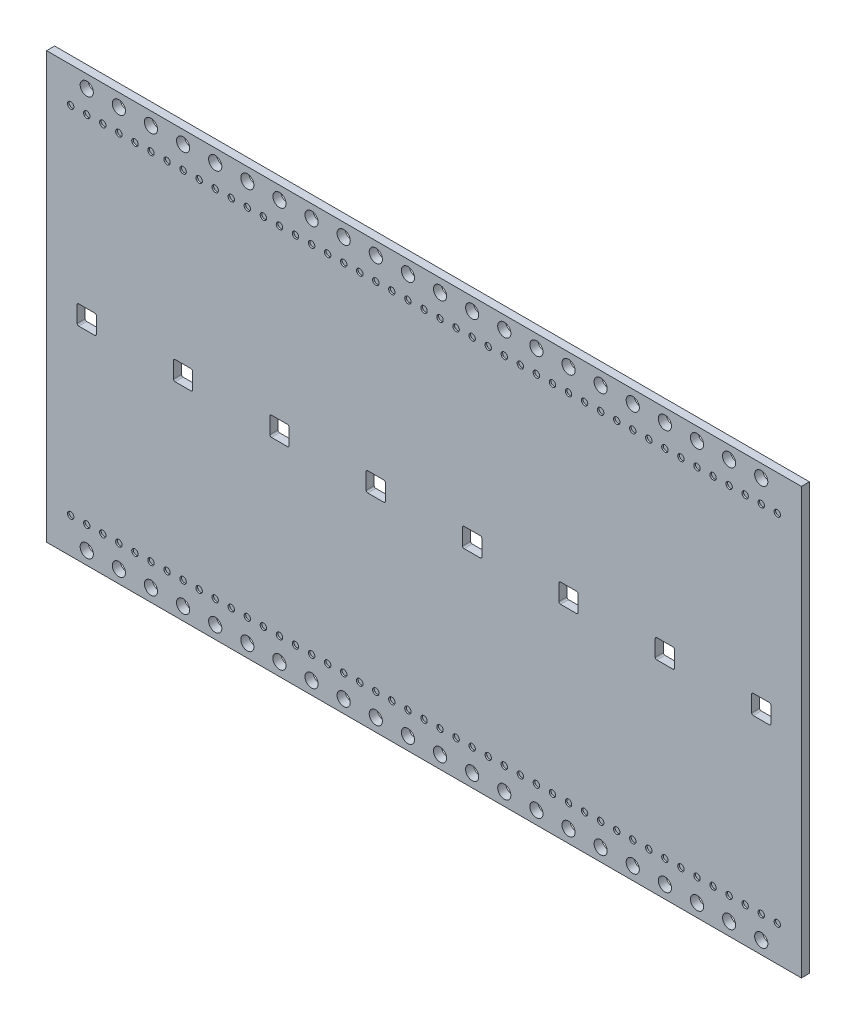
from build123d import *

# Parameters (mm, degrees)
SKETCH_1_W          = 235
SKETCH_1_H          = 132.55
SKETCH_1_R          = 2.05
EXTRUDE_1_DEPTH     = 1.25
SKETCH_2_R          = 1
CUT_EXTRUDE_1_DEPTH = 0.5
SKETCH_3_R          = 1
EXTRUDE_2_DEPTH     = 1
CUT_EXTRUDE_2_DEPTH = 10


with BuildPart() as part:
    # Sketch 1 → Extrude 1 (new, symmetric)
    with BuildSketch(Plane.XY):
        Rectangle(SKETCH_1_W, SKETCH_1_H)
        with Locations((-105, 62.275)):
            Circle(SKETCH_1_R, mode=Mode.SUBTRACT)
        with Locations((-95, 62.275)):
            Circle(SKETCH_1_R, mode=Mode.SUBTRACT)
        with Locations((-95, -62.275)):
            Circle(SKETCH_1_R, mode=Mode.SUBTRACT)
        with Locations((-85, 62.275)):
            Circle(SKETCH_1_R, mode=Mode.SUBTRACT)
        with Locations((-85, -62.275)):
            Circle(SKETCH_1_R, mode=Mode.SUBTRACT)
        with Locations((-75, 62.275)):
            Circle(SKETCH_1_R, mode=Mode.SUBTRACT)
        with Locations((-75, -62.275)):
            Circle(SKETCH_1_R, mode=Mode.SUBTRACT)
        with Locations((-65, 62.275)):
            Circle(SKETCH_1_R, mode=Mode.SUBTRACT)
        with Locations((-65, -62.275)):
            Circle(SKETCH_1_R, mode=Mode.SUBTRACT)
        with Locations((-55, 62.275)):
            Circle(SKETCH_1_R, mode=Mode.SUBTRACT)
        with Locations((-55, -62.275)):
            Circle(SKETCH_1_R, mode=Mode.SUBTRACT)
        with Locations((-45, 62.275)):
            Circle(SKETCH_1_R, mode=Mode.SUBTRACT)
        with Locations((-45, -62.275)):
            Circle(SKETCH_1_R, mode=Mode.SUBTRACT)
        with Locations((-35, 62.275)):
            Circle(SKETCH_1_R, mode=Mode.SUBTRACT)
        with Locations((-35, -62.275)):
            Circle(SKETCH_1_R, mode=Mode.SUBTRACT)
        with Locations((-25, 62.275)):
            Circle(SKETCH_1_R, mode=Mode.SUBTRACT)
        with Locations((-25, -62.275)):
            Circle(SKETCH_1_R, mode=Mode.SUBTRACT)
        with Locations((-15, 62.275)):
            Circle(SKETCH_1_R, mode=Mode.SUBTRACT)
        with Locations((-15, -62.275)):
            Circle(SKETCH_1_R, mode=Mode.SUBTRACT)
        with Locations((-5, 62.275)):
            Circle(SKETCH_1_R, mode=Mode.SUBTRACT)
        with Locations((-5, -62.275)):
            Circle(SKETCH_1_R, mode=Mode.SUBTRACT)
        with Locations((5, 62.275)):
            Circle(SKETCH_1_R, mode=Mode.SUBTRACT)
        with Locations((5, -62.275)):
            Circle(SKETCH_1_R, mode=Mode.SUBTRACT)
        with Locations((15, 62.275)):
            Circle(SKETCH_1_R, mode=Mode.SUBTRACT)
        with Locations((15, -62.275)):
            Circle(SKETCH_1_R, mode=Mode.SUBTRACT)
        with Locations((25, 62.275)):
            Circle(SKETCH_1_R, mode=Mode.SUBTRACT)
        with Locations((25, -62.275)):
            Circle(SKETCH_1_R, mode=Mode.SUBTRACT)
        with Locations((35, 62.275)):
            Circle(SKETCH_1_R, mode=Mode.SUBTRACT)
        with Locations((35, -62.275)):
            Circle(SKETCH_1_R, mode=Mode.SUBTRACT)
        with Locations((45, 62.275)):
            Circle(SKETCH_1_R, mode=Mode.SUBTRACT)
        with Locations((45, -62.275)):
            Circle(SKETCH_1_R, mode=Mode.SUBTRACT)
        with Locations((55, 62.275)):
            Circle(SKETCH_1_R, mode=Mode.SUBTRACT)
        with Locations((55, -62.275)):
            Circle(SKETCH_1_R, mode=Mode.SUBTRACT)
        with Locations((65, 62.275)):
            Circle(SKETCH_1_R, mode=Mode.SUBTRACT)
        with Locations((65, -62.275)):
            Circle(SKETCH_1_R, mode=Mode.SUBTRACT)
        with Locations((75, 62.275)):
            Circle(SKETCH_1_R, mode=Mode.SUBTRACT)
        with Locations((75, -62.275)):
            Circle(SKETCH_1_R, mode=Mode.SUBTRACT)
        with Locations((85, 62.275)):
            Circle(SKETCH_1_R, mode=Mode.SUBTRACT)
        with Locations((85, -62.275)):
            Circle(SKETCH_1_R, mode=Mode.SUBTRACT)
        with Locations((95, 62.275)):
            Circle(SKETCH_1_R, mode=Mode.SUBTRACT)
        with Locations((95, -62.275)):
            Circle(SKETCH_1_R, mode=Mode.SUBTRACT)
        with Locations((105, 62.275)):
            Circle(SKETCH_1_R, mode=Mode.SUBTRACT)
        with Locations((105, -62.275)):
            Circle(SKETCH_1_R, mode=Mode.SUBTRACT)
        with Locations((-105, -62.275)):
            Circle(SKETCH_1_R, mode=Mode.SUBTRACT)
    extrude(amount=EXTRUDE_1_DEPTH, both=True)

    # Sketch 2 → Cut-Extrude 1 (cut)
    with BuildSketch(Plane.XY.offset(1.25)):
        with Locations((-110, 55.275)):
            Circle(SKETCH_2_R)
        with Locations((-110, -55.275)):
            Circle(SKETCH_2_R)
        with Locations((-105, 55.275)):
            Circle(SKETCH_2_R)
        with Locations((-105, -55.275)):
            Circle(SKETCH_2_R)
        with Locations((-100, 55.275)):
            Circle(SKETCH_2_R)
        with Locations((-100, -55.275)):
            Circle(SKETCH_2_R)
        with Locations((-95, 55.275)):
            Circle(SKETCH_2_R)
        with Locations((-95, -55.275)):
            Circle(SKETCH_2_R)
        with Locations((-90, 55.275)):
            Circle(SKETCH_2_R)
        with Locations((-90, -55.275)):
            Circle(SKETCH_2_R)
        with Locations((-85, 55.275)):
            Circle(SKETCH_2_R)
        with Locations((-85, -55.275)):
            Circle(SKETCH_2_R)
        with Locations((-80, 55.275)):
            Circle(SKETCH_2_R)
        with Locations((-80, -55.275)):
            Circle(SKETCH_2_R)
        with Locations((-75, 55.275)):
            Circle(SKETCH_2_R)
        with Locations((-75, -55.275)):
            Circle(SKETCH_2_R)
        with Locations((-70, 55.275)):
            Circle(SKETCH_2_R)
        with Locations((-70, -55.275)):
            Circle(SKETCH_2_R)
        with Locations((-65, 55.275)):
            Circle(SKETCH_2_R)
        with Locations((-65, -55.275)):
            Circle(SKETCH_2_R)
        with Locations((-60, 55.275)):
            Circle(SKETCH_2_R)
        with Locations((-60, -55.275)):
            Circle(SKETCH_2_R)
        with Locations((-55, 55.275)):
            Circle(SKETCH_2_R)
        with Locations((-55, -55.275)):
            Circle(SKETCH_2_R)
        with Locations((-50, 55.275)):
            Circle(SKETCH_2_R)
        with Locations((-50, -55.275)):
            Circle(SKETCH_2_R)
        with Locations((-45, 55.275)):
            Circle(SKETCH_2_R)
        with Locations((-45, -55.275)):
            Circle(SKETCH_2_R)
        with Locations((-40, 55.275)):
            Circle(SKETCH_2_R)
        with Locations((-40, -55.275)):
            Circle(SKETCH_2_R)
        with Locations((-35, 55.275)):
            Circle(SKETCH_2_R)
        with Locations((-35, -55.275)):
            Circle(SKETCH_2_R)
        with Locations((-30, 55.275)):
            Circle(SKETCH_2_R)
        with Locations((-30, -55.275)):
            Circle(SKETCH_2_R)
        with Locations((-25, 55.275)):
            Circle(SKETCH_2_R)
        with Locations((-25, -55.275)):
            Circle(SKETCH_2_R)
        with Locations((-20, 55.275)):
            Circle(SKETCH_2_R)
        with Locations((-20, -55.275)):
            Circle(SKETCH_2_R)
        with Locations((-15, 55.275)):
            Circle(SKETCH_2_R)
        with Locations((-15, -55.275)):
            Circle(SKETCH_2_R)
        with Locations((-10, 55.275)):
            Circle(SKETCH_2_R)
        with Locations((-10, -55.275)):
            Circle(SKETCH_2_R)
        with Locations((-5, 55.275)):
            Circle(SKETCH_2_R)
        with Locations((-5, -55.275)):
            Circle(SKETCH_2_R)
        with Locations((0, 55.275)):
            Circle(SKETCH_2_R)
        with Locations((0, -55.275)):
            Circle(SKETCH_2_R)
        with Locations((5, 55.275)):
            Circle(SKETCH_2_R)
        with Locations((5, -55.275)):
            Circle(SKETCH_2_R)
        with Locations((10, 55.275)):
            Circle(SKETCH_2_R)
        with Locations((10, -55.275)):
            Circle(SKETCH_2_R)
        with Locations((15, 55.275)):
            Circle(SKETCH_2_R)
        with Locations((15, -55.275)):
            Circle(SKETCH_2_R)
        with Locations((20, 55.275)):
            Circle(SKETCH_2_R)
        with Locations((20, -55.275)):
            Circle(SKETCH_2_R)
        with Locations((25, 55.275)):
            Circle(SKETCH_2_R)
        with Locations((25, -55.275)):
            Circle(SKETCH_2_R)
        with Locations((30, 55.275)):
            Circle(SKETCH_2_R)
        with Locations((30, -55.275)):
            Circle(SKETCH_2_R)
        with Locations((35, 55.275)):
            Circle(SKETCH_2_R)
        with Locations((35, -55.275)):
            Circle(SKETCH_2_R)
        with Locations((40, 55.275)):
            Circle(SKETCH_2_R)
        with Locations((40, -55.275)):
            Circle(SKETCH_2_R)
        with Locations((45, 55.275)):
            Circle(SKETCH_2_R)
        with Locations((45, -55.275)):
            Circle(SKETCH_2_R)
        with Locations((50, 55.275)):
            Circle(SKETCH_2_R)
        with Locations((50, -55.275)):
            Circle(SKETCH_2_R)
        with Locations((55, 55.275)):
            Circle(SKETCH_2_R)
        with Locations((55, -55.275)):
            Circle(SKETCH_2_R)
        with Locations((60, 55.275)):
            Circle(SKETCH_2_R)
        with Locations((60, -55.275)):
            Circle(SKETCH_2_R)
        with Locations((65, 55.275)):
            Circle(SKETCH_2_R)
        with Locations((65, -55.275)):
            Circle(SKETCH_2_R)
        with Locations((70, 55.275)):
            Circle(SKETCH_2_R)
        with Locations((70, -55.275)):
            Circle(SKETCH_2_R)
        with Locations((75, 55.275)):
            Circle(SKETCH_2_R)
        with Locations((75, -55.275)):
            Circle(SKETCH_2_R)
        with Locations((80, 55.275)):
            Circle(SKETCH_2_R)
        with Locations((80, -55.275)):
            Circle(SKETCH_2_R)
        with Locations((85, 55.275)):
            Circle(SKETCH_2_R)
        with Locations((85, -55.275)):
            Circle(SKETCH_2_R)
        with Locations((90, 55.275)):
            Circle(SKETCH_2_R)
        with Locations((90, -55.275)):
            Circle(SKETCH_2_R)
        with Locations((95, 55.275)):
            Circle(SKETCH_2_R)
        with Locations((95, -55.275)):
            Circle(SKETCH_2_R)
        with Locations((100, 55.275)):
            Circle(SKETCH_2_R)
        with Locations((100, -55.275)):
            Circle(SKETCH_2_R)
        with Locations((105, 55.275)):
            Circle(SKETCH_2_R)
        with Locations((105, -55.275)):
            Circle(SKETCH_2_R)
        with Locations((110, 55.275)):
            Circle(SKETCH_2_R)
        with Locations((110, -55.275)):
            Circle(SKETCH_2_R)
    extrude(amount=-CUT_EXTRUDE_1_DEPTH, mode=Mode.SUBTRACT)

    # Sketch 3 → Extrude 2 (add)
    with BuildSketch(Plane(origin=(0, 0, -1.25), x_dir=(-1, 0, 0), z_dir=(0, 0, -1))):
        with Locations(Location((110, 55.275, 0), (0, 0, 180))):
            Circle(SKETCH_3_R)
        with Locations(Location((110, -55.275, 0), (0, 0, 180))):
            Circle(SKETCH_3_R)
        with Locations(Location((105, 55.275, 0), (0, 0, 180))):
            Circle(SKETCH_3_R)
        with Locations(Location((105, -55.275, 0), (0, 0, 180))):
            Circle(SKETCH_3_R)
        with Locations(Location((100, 55.275, 0), (0, 0, 180))):
            Circle(SKETCH_3_R)
        with Locations(Location((100, -55.275, 0), (0, 0, 180))):
            Circle(SKETCH_3_R)
        with Locations(Location((95, 55.275, 0), (0, 0, 180))):
            Circle(SKETCH_3_R)
        with Locations(Location((95, -55.275, 0), (0, 0, 180))):
            Circle(SKETCH_3_R)
        with Locations(Location((90, 55.275, 0), (0, 0, 180))):
            Circle(SKETCH_3_R)
        with Locations(Location((90, -55.275, 0), (0, 0, 180))):
            Circle(SKETCH_3_R)
        with Locations(Location((85, 55.275, 0), (0, 0, 180))):
            Circle(SKETCH_3_R)
        with Locations(Location((85, -55.275, 0), (0, 0, 180))):
            Circle(SKETCH_3_R)
        with Locations(Location((80, 55.275, 0), (0, 0, 180))):
            Circle(SKETCH_3_R)
        with Locations(Location((80, -55.275, 0), (0, 0, 180))):
            Circle(SKETCH_3_R)
        with Locations(Location((75, 55.275, 0), (0, 0, 180))):
            Circle(SKETCH_3_R)
        with Locations(Location((75, -55.275, 0), (0, 0, 180))):
            Circle(SKETCH_3_R)
        with Locations(Location((70, 55.275, 0), (0, 0, 180))):
            Circle(SKETCH_3_R)
        with Locations(Location((70, -55.275, 0), (0, 0, 180))):
            Circle(SKETCH_3_R)
        with Locations(Location((65, 55.275, 0), (0, 0, 180))):
            Circle(SKETCH_3_R)
        with Locations(Location((65, -55.275, 0), (0, 0, 180))):
            Circle(SKETCH_3_R)
        with Locations(Location((60, 55.275, 0), (0, 0, 180))):
            Circle(SKETCH_3_R)
        with Locations(Location((60, -55.275, 0), (0, 0, 180))):
            Circle(SKETCH_3_R)
        with Locations(Location((55, 55.275, 0), (0, 0, 180))):
            Circle(SKETCH_3_R)
        with Locations(Location((55, -55.275, 0), (0, 0, 180))):
            Circle(SKETCH_3_R)
        with Locations(Location((50, 55.275, 0), (0, 0, 180))):
            Circle(SKETCH_3_R)
        with Locations(Location((50, -55.275, 0), (0, 0, 180))):
            Circle(SKETCH_3_R)
        with Locations(Location((45, 55.275, 0), (0, 0, 180))):
            Circle(SKETCH_3_R)
        with Locations(Location((45, -55.275, 0), (0, 0, 180))):
            Circle(SKETCH_3_R)
        with Locations(Location((40, 55.275, 0), (0, 0, 180))):
            Circle(SKETCH_3_R)
        with Locations(Location((40, -55.275, 0), (0, 0, 180))):
            Circle(SKETCH_3_R)
        with Locations(Location((35, 55.275, 0), (0, 0, 180))):
            Circle(SKETCH_3_R)
        with Locations(Location((35, -55.275, 0), (0, 0, 180))):
            Circle(SKETCH_3_R)
        with Locations(Location((30, 55.275, 0), (0, 0, 180))):
            Circle(SKETCH_3_R)
        with Locations(Location((30, -55.275, 0), (0, 0, 180))):
            Circle(SKETCH_3_R)
        with Locations(Location((25, 55.275, 0), (0, 0, 180))):
            Circle(SKETCH_3_R)
        with Locations(Location((25, -55.275, 0), (0, 0, 180))):
            Circle(SKETCH_3_R)
        with Locations(Location((20, 55.275, 0), (0, 0, 180))):
            Circle(SKETCH_3_R)
        with Locations(Location((20, -55.275, 0), (0, 0, 180))):
            Circle(SKETCH_3_R)
        with Locations(Location((15, 55.275, 0), (0, 0, 180))):
            Circle(SKETCH_3_R)
        with Locations(Location((15, -55.275, 0), (0, 0, 180))):
            Circle(SKETCH_3_R)
        with Locations(Location((10, 55.275, 0), (0, 0, 180))):
            Circle(SKETCH_3_R)
        with Locations(Location((10, -55.275, 0), (0, 0, 180))):
            Circle(SKETCH_3_R)
        with Locations(Location((5, 55.275, 0), (0, 0, 180))):
            Circle(SKETCH_3_R)
        with Locations(Location((5, -55.275, 0), (0, 0, 180))):
            Circle(SKETCH_3_R)
        with Locations(Location((0, 55.275, 0), (0, 0, 180))):
            Circle(SKETCH_3_R)
        with Locations(Location((0, -55.275, 0), (0, 0, 180))):
            Circle(SKETCH_3_R)
        with Locations(Location((-5, 55.275, 0), (0, 0, 180))):
            Circle(SKETCH_3_R)
        with Locations(Location((-5, -55.275, 0), (0, 0, 180))):
            Circle(SKETCH_3_R)
        with Locations(Location((-10, 55.275, 0), (0, 0, 180))):
            Circle(SKETCH_3_R)
        with Locations(Location((-10, -55.275, 0), (0, 0, 180))):
            Circle(SKETCH_3_R)
        with Locations(Location((-15, 55.275, 0), (0, 0, 180))):
            Circle(SKETCH_3_R)
        with Locations(Location((-15, -55.275, 0), (0, 0, 180))):
            Circle(SKETCH_3_R)
        with Locations(Location((-20, 55.275, 0), (0, 0, 180))):
            Circle(SKETCH_3_R)
        with Locations(Location((-20, -55.275, 0), (0, 0, 180))):
            Circle(SKETCH_3_R)
        with Locations(Location((-25, 55.275, 0), (0, 0, 180))):
            Circle(SKETCH_3_R)
        with Locations(Location((-25, -55.275, 0), (0, 0, 180))):
            Circle(SKETCH_3_R)
        with Locations(Location((-30, 55.275, 0), (0, 0, 180))):
            Circle(SKETCH_3_R)
        with Locations(Location((-30, -55.275, 0), (0, 0, 180))):
            Circle(SKETCH_3_R)
        with Locations(Location((-35, 55.275, 0), (0, 0, 180))):
            Circle(SKETCH_3_R)
        with Locations(Location((-35, -55.275, 0), (0, 0, 180))):
            Circle(SKETCH_3_R)
        with Locations(Location((-40, 55.275, 0), (0, 0, 180))):
            Circle(SKETCH_3_R)
        with Locations(Location((-40, -55.275, 0), (0, 0, 180))):
            Circle(SKETCH_3_R)
        with Locations(Location((-45, 55.275, 0), (0, 0, 180))):
            Circle(SKETCH_3_R)
        with Locations(Location((-45, -55.275, 0), (0, 0, 180))):
            Circle(SKETCH_3_R)
        with Locations(Location((-50, 55.275, 0), (0, 0, 180))):
            Circle(SKETCH_3_R)
        with Locations(Location((-50, -55.275, 0), (0, 0, 180))):
            Circle(SKETCH_3_R)
        with Locations(Location((-55, 55.275, 0), (0, 0, 180))):
            Circle(SKETCH_3_R)
        with Locations(Location((-55, -55.275, 0), (0, 0, 180))):
            Circle(SKETCH_3_R)
        with Locations(Location((-60, 55.275, 0), (0, 0, 180))):
            Circle(SKETCH_3_R)
        with Locations(Location((-60, -55.275, 0), (0, 0, 180))):
            Circle(SKETCH_3_R)
        with Locations(Location((-65, 55.275, 0), (0, 0, 180))):
            Circle(SKETCH_3_R)
        with Locations(Location((-65, -55.275, 0), (0, 0, 180))):
            Circle(SKETCH_3_R)
        with Locations(Location((-70, 55.275, 0), (0, 0, 180))):
            Circle(SKETCH_3_R)
        with Locations(Location((-70, -55.275, 0), (0, 0, 180))):
            Circle(SKETCH_3_R)
        with Locations(Location((-75, 55.275, 0), (0, 0, 180))):
            Circle(SKETCH_3_R)
        with Locations(Location((-75, -55.275, 0), (0, 0, 180))):
            Circle(SKETCH_3_R)
        with Locations(Location((-80, 55.275, 0), (0, 0, 180))):
            Circle(SKETCH_3_R)
        with Locations(Location((-80, -55.275, 0), (0, 0, 180))):
            Circle(SKETCH_3_R)
        with Locations(Location((-85, 55.275, 0), (0, 0, 180))):
            Circle(SKETCH_3_R)
        with Locations(Location((-85, -55.275, 0), (0, 0, 180))):
            Circle(SKETCH_3_R)
        with Locations(Location((-90, 55.275, 0), (0, 0, 180))):
            Circle(SKETCH_3_R)
        with Locations(Location((-90, -55.275, 0), (0, 0, 180))):
            Circle(SKETCH_3_R)
        with Locations(Location((-95, 55.275, 0), (0, 0, 180))):
            Circle(SKETCH_3_R)
        with Locations(Location((-95, -55.275, 0), (0, 0, 180))):
            Circle(SKETCH_3_R)
        with Locations(Location((-100, 55.275, 0), (0, 0, 180))):
            Circle(SKETCH_3_R)
        with Locations(Location((-100, -55.275, 0), (0, 0, 180))):
            Circle(SKETCH_3_R)
        with Locations(Location((-105, 55.275, 0), (0, 0, 180))):
            Circle(SKETCH_3_R)
        with Locations(Location((-105, -55.275, 0), (0, 0, 180))):
            Circle(SKETCH_3_R)
        with Locations(Location((-110, 55.275, 0), (0, 0, 180))):
            Circle(SKETCH_3_R)
        with Locations(Location((-110, -55.275, 0), (0, 0, 180))):
            Circle(SKETCH_3_R)
    extrude(amount=EXTRUDE_2_DEPTH)

    # Sketch 4 → Cut-Extrude 2 (cut)
    with BuildSketch(Plane.XY.offset(1.25)):
        with BuildLine():
            Line((-107.5, -3), (-102.5, -3))
            ThreePointArc((-102.5, -3), (-102.146446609, -2.853553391), (-102, -2.5))
            Line((-102, -2.5), (-102, 2.5))
            ThreePointArc((-102, 2.5), (-102.146446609, 2.853553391), (-102.5, 3))
            Line((-102.5, 3), (-107.5, 3))
            ThreePointArc((-107.5, 3), (-107.853553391, 2.853553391), (-108, 2.5))
            Line((-108, 2.5), (-108, -2.5))
            ThreePointArc((-108, -2.5), (-107.853553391, -2.853553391), (-107.5, -3))
        make_face()
        with BuildLine():
            Line((-77.5, 3), (-72.5, 3))
            ThreePointArc((-72.5, 3), (-72.146446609, 2.853553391), (-72, 2.5))
            Line((-72, 2.5), (-72, -2.5))
            ThreePointArc((-72, -2.5), (-72.146446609, -2.853553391), (-72.5, -3))
            Line((-72.5, -3), (-77.5, -3))
            ThreePointArc((-77.5, -3), (-77.853553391, -2.853553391), (-78, -2.5))
            Line((-78, -2.5), (-78, 2.5))
            ThreePointArc((-78, 2.5), (-77.853553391, 2.853553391), (-77.5, 3))
        make_face()
        with BuildLine():
            Line((-47.5, 3), (-42.5, 3))
            ThreePointArc((-42.5, 3), (-42.146446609, 2.853553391), (-42, 2.5))
            Line((-42, 2.5), (-42, -2.5))
            ThreePointArc((-42, -2.5), (-42.146446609, -2.853553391), (-42.5, -3))
            Line((-42.5, -3), (-47.5, -3))
            ThreePointArc((-47.5, -3), (-47.853553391, -2.853553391), (-48, -2.5))
            Line((-48, -2.5), (-48, 2.5))
            ThreePointArc((-48, 2.5), (-47.853553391, 2.853553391), (-47.5, 3))
        make_face()
        with BuildLine():
            Line((-17.5, 3), (-12.5, 3))
            ThreePointArc((-12.5, 3), (-12.146446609, 2.853553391), (-12, 2.5))
            Line((-12, 2.5), (-12, -2.5))
            ThreePointArc((-12, -2.5), (-12.146446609, -2.853553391), (-12.5, -3))
            Line((-12.5, -3), (-17.5, -3))
            ThreePointArc((-17.5, -3), (-17.853553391, -2.853553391), (-18, -2.5))
            Line((-18, -2.5), (-18, 2.5))
            ThreePointArc((-18, 2.5), (-17.853553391, 2.853553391), (-17.5, 3))
        make_face()
        with BuildLine():
            Line((12.5, 3), (17.5, 3))
            ThreePointArc((17.5, 3), (17.853553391, 2.853553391), (18, 2.5))
            Line((18, 2.5), (18, -2.5))
            ThreePointArc((18, -2.5), (17.853553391, -2.853553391), (17.5, -3))
            Line((17.5, -3), (12.5, -3))
            ThreePointArc((12.5, -3), (12.146446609, -2.853553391), (12, -2.5))
            Line((12, -2.5), (12, 2.5))
            ThreePointArc((12, 2.5), (12.146446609, 2.853553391), (12.5, 3))
        make_face()
        with BuildLine():
            Line((42.5, 3), (47.5, 3))
            ThreePointArc((47.5, 3), (47.853553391, 2.853553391), (48, 2.5))
            Line((48, 2.5), (48, -2.5))
            ThreePointArc((48, -2.5), (47.853553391, -2.853553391), (47.5, -3))
            Line((47.5, -3), (42.5, -3))
            ThreePointArc((42.5, -3), (42.146446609, -2.853553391), (42, -2.5))
            Line((42, -2.5), (42, 2.5))
            ThreePointArc((42, 2.5), (42.146446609, 2.853553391), (42.5, 3))
        make_face()
        with BuildLine():
            Line((72.5, 3), (77.5, 3))
            ThreePointArc((77.5, 3), (77.853553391, 2.853553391), (78, 2.5))
            Line((78, 2.5), (78, -2.5))
            ThreePointArc((78, -2.5), (77.853553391, -2.853553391), (77.5, -3))
            Line((77.5, -3), (72.5, -3))
            ThreePointArc((72.5, -3), (72.146446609, -2.853553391), (72, -2.5))
            Line((72, -2.5), (72, 2.5))
            ThreePointArc((72, 2.5), (72.146446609, 2.853553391), (72.5, 3))
        make_face()
        with BuildLine():
            Line((102.5, 3), (107.5, 3))
            ThreePointArc((107.5, 3), (107.853553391, 2.853553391), (108, 2.5))
            Line((108, 2.5), (108, -2.5))
            ThreePointArc((108, -2.5), (107.853553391, -2.853553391), (107.5, -3))
            Line((107.5, -3), (102.5, -3))
            ThreePointArc((102.5, -3), (102.146446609, -2.853553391), (102, -2.5))
            Line((102, -2.5), (102, 2.5))
            ThreePointArc((102, 2.5), (102.146446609, 2.853553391), (102.5, 3))
        make_face()
    extrude(amount=-CUT_EXTRUDE_2_DEPTH, mode=Mode.SUBTRACT)


solid = part.part
